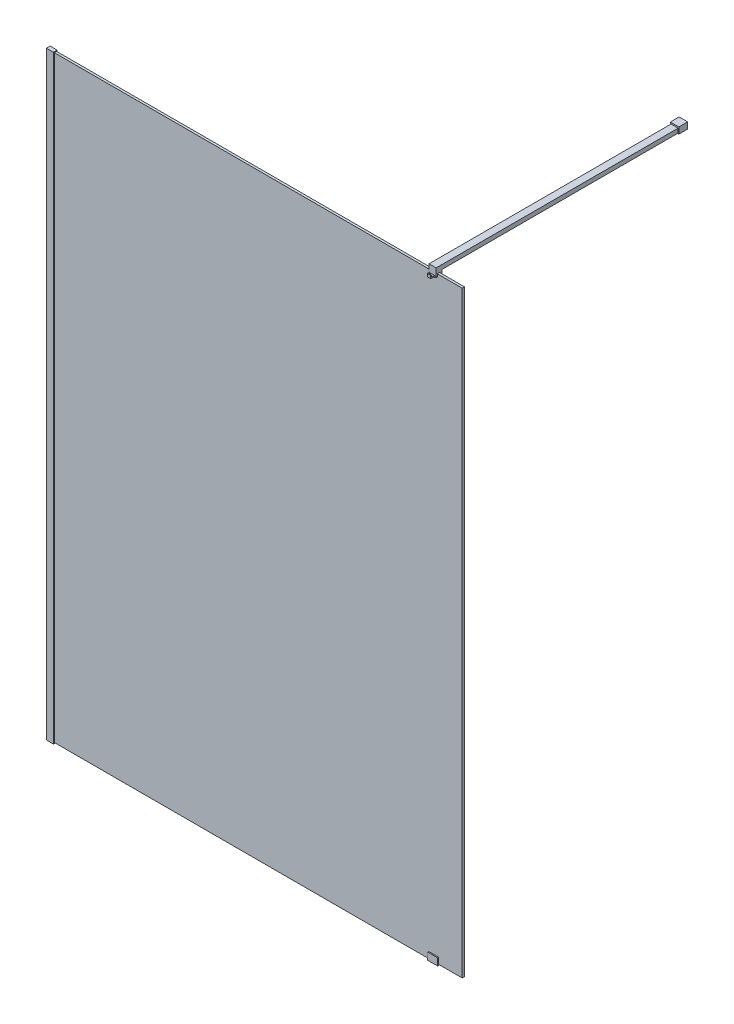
from build123d import *

# Parameters (mm, degrees)
DODANIE_WYCI_GNI_CIE1_DEPTH     = 2100
SZKIC2_W                        = 1447
SZKIC2_H                        = 8
DODANIE_WYCI_GNI_CIE2_DEPTH     = 2100
SZKIC4_W                        = 25
SZKIC4_H                        = 13.3
DODANIE_WYCI_GNI_CIE3_DEPTH     = 3
SZKIC5_W                        = 25
SZKIC5_H                        = 13.3
DODANIE_WYCI_GNI_CIE4_DEPTH     = 3
DODANIE_WYCI_GNI_CIE5_DEPTH     = 17.5
DODANIE_WYCI_GNI_CIE6_DEPTH     = 12.5
WYTNIJ_WYCI_GNI_CIE1_DEPTH      = 2560.308844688
WYTNIJ_WYCI_GNI_CIE1_DEPTH_BACK = 2560.308844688
SZKIC10_W                       = 25
SZKIC10_H                       = 861.63
DODANIE_WYCI_GNI_CIE7_DEPTH     = 15
SZKIC14_W                       = 30
SZKIC14_H                       = 22
DODANIE_WYCI_GNI_CIE8_DEPTH     = 31


with BuildPart() as part:
    # Szkic1 → Dodanie-wyci_gni_cie1 (new body)
    with BuildSketch(Plane(origin=(0, 0, 0), x_dir=(1, 0, 0), z_dir=(0, 1, 0))):
        Polygon((0, 0), (0, 13.3), (25, 13.3), (25, 11.4), (11.45, 11.4), (11.45, 3.4), (25, 3.4), (25, 0), align=None)
    extrude(amount=DODANIE_WYCI_GNI_CIE1_DEPTH)

    # Szkic4 → Dodanie-wyci_gni_cie3 (add)
    with BuildSketch(Plane(origin=(0, 2100, 0), x_dir=(1, 0, 0), z_dir=(0, 1, 0))):
        with Locations((12.5, 6.65)):
            Rectangle(SZKIC4_W, SZKIC4_H)
    extrude(amount=DODANIE_WYCI_GNI_CIE3_DEPTH)

    # Szkic5 → Dodanie-wyci_gni_cie4 (add)
    with BuildSketch(Plane.XZ):
        with Locations((12.5, -6.65)):
            Rectangle(SZKIC5_W, SZKIC5_H)
    extrude(amount=DODANIE_WYCI_GNI_CIE4_DEPTH)


with BuildPart() as body_2:
    # Szkic2 → Dodanie-wyci_gni_cie2 (new body)
    with BuildSketch(Plane.XZ):
        with Locations((734.95, -7.4)):
            Rectangle(SZKIC2_W, SZKIC2_H)
    extrude(amount=-DODANIE_WYCI_GNI_CIE2_DEPTH)


with BuildPart() as body_3:
    # Szkic6 → Dodanie-wyci_gni_cie5 (new, symmetric)
    with BuildSketch(Plane(origin=(1358.45, 0, 0), x_dir=(0, 0, -1), z_dir=(1, 0, 0))):
        Polygon((11.4, 22), (15.75, 22), (15.75, -3), (-0.35, -3), (-0.35, 22), (3.4, 22), (3.4, 0), (11.4, 0), align=None)
    extrude(amount=DODANIE_WYCI_GNI_CIE5_DEPTH, both=True)


with BuildPart() as body_4:
    # Szkic7 → Dodanie-wyci_gni_cie6 (new, symmetric)
    with BuildSketch(Plane(origin=(1358.45, 0, 0), x_dir=(0, 0, -1), z_dir=(1, 0, 0))):
        Polygon((-0.6, 2120), (19.4, 2120), (19.4, 2090), (11.4, 2090), (11.4, 2100), (3.4, 2100), (3.4, 2090), (-13.37, 2090), (-13.37, 2100), (-10.37, 2100), (-9.845068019, 2094), (-0.6, 2094), align=None)
    extrude(amount=DODANIE_WYCI_GNI_CIE6_DEPTH, both=True)

    # Szkic8 → Wytnij-wyci_gni_cie1 (cut, two sides: drawn at the far end of the back side and taken through both)
    with BuildSketch(Plane(origin=(0, 2100, 0), x_dir=(1, 0, 0), z_dir=(0, 1, 0)).offset(-WYTNIJ_WYCI_GNI_CIE1_DEPTH_BACK)):
        Polygon((-1148.382817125, 1162.526494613), (1345.95, -0.6), (1352.45, -3.630999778), (1352.45, -13.37), (1364.45, -13.37), (1364.45, -3.630999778), (1370.95, -0.6), (3865.282817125, 1162.526494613), (3865.282817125, -4341.857011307), (-1148.382817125, -4341.857011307), align=None)
    extrude(amount=WYTNIJ_WYCI_GNI_CIE1_DEPTH + WYTNIJ_WYCI_GNI_CIE1_DEPTH_BACK, mode=Mode.SUBTRACT)

    # Szkic10 → Dodanie-wyci_gni_cie7 (add)
    with BuildSketch(Plane(origin=(0, 2120, 0), x_dir=(1, 0, 0), z_dir=(0, 1, 0))):
        with Locations((1358.45, 450.215)):
            Rectangle(SZKIC10_W, SZKIC10_H)
    extrude(amount=-DODANIE_WYCI_GNI_CIE7_DEPTH)

    # Szkic14 → Dodanie-wyci_gni_cie8 (add)
    with BuildSketch(Plane(origin=(0, 0, -881.03), x_dir=(-1, 0, 0), z_dir=(0, 0, -1))):
        with Locations((-1358.45, 2114)):
            Rectangle(SZKIC14_W, SZKIC14_H)
    extrude(amount=-DODANIE_WYCI_GNI_CIE8_DEPTH)


solid = Compound([part.part, body_2.part, body_3.part, body_4.part])
